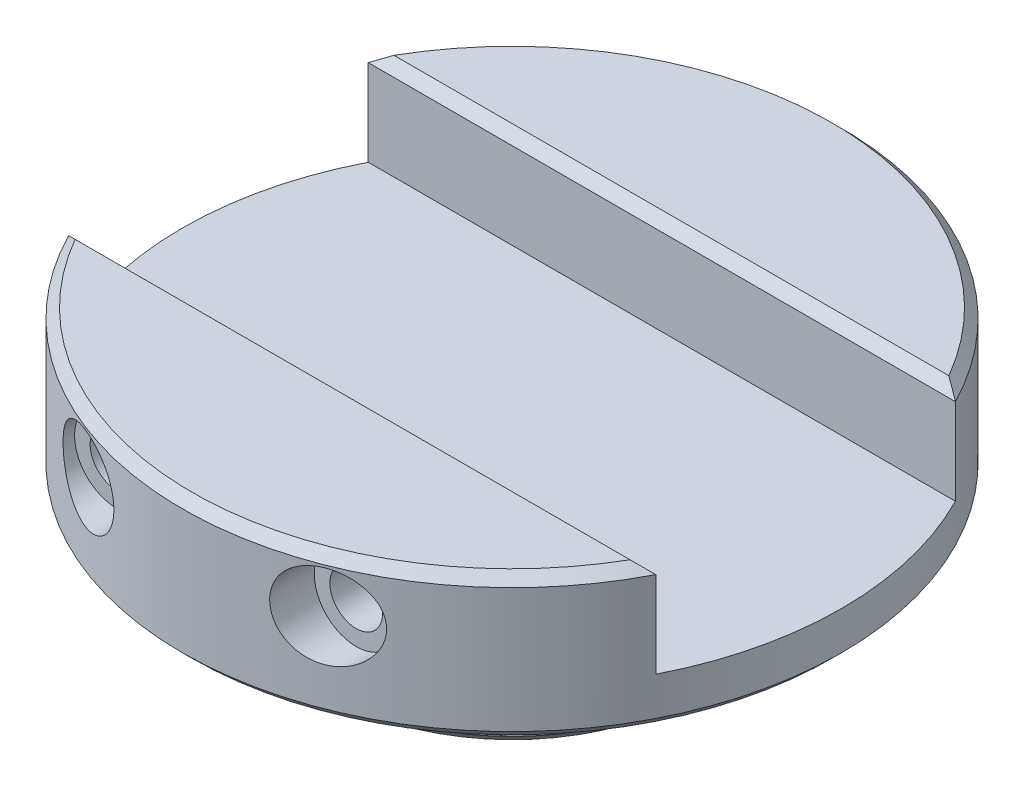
ISO-10303-21;
HEADER;
FILE_DESCRIPTION(('STEP AP214'),'2;1');
FILE_NAME('part.step','',(''),(''),'','','');
FILE_SCHEMA(('AUTOMOTIVE_DESIGN { 1 0 10303 214 1 1 1 1 }'));
ENDSEC;
DATA;
#1=APPLICATION_CONTEXT('core data for automotive mechanical design processes');
#2=APPLICATION_PROTOCOL_DEFINITION('international standard','automotive_design',2000,#1);
#3=PRODUCT_CONTEXT('',#1,'mechanical');
#4=PRODUCT('Part','Part','',(#3));
#5=PRODUCT_RELATED_PRODUCT_CATEGORY('part','',(#4));
#6=PRODUCT_DEFINITION_FORMATION('','',#4);
#7=PRODUCT_DEFINITION_CONTEXT('part definition',#1,'design');
#8=PRODUCT_DEFINITION('design','',#6,#7);
#9=PRODUCT_DEFINITION_SHAPE('','',#8);
#10=(LENGTH_UNIT() NAMED_UNIT(*) SI_UNIT(.MILLI.,.METRE.));
#11=(NAMED_UNIT(*) PLANE_ANGLE_UNIT() SI_UNIT($,.RADIAN.));
#12=(NAMED_UNIT(*) SI_UNIT($,.STERADIAN.) SOLID_ANGLE_UNIT());
#13=UNCERTAINTY_MEASURE_WITH_UNIT(LENGTH_MEASURE(1.E-05),#10,'distance_accuracy_value','');
#14=(GEOMETRIC_REPRESENTATION_CONTEXT(3) GLOBAL_UNCERTAINTY_ASSIGNED_CONTEXT((#13)) GLOBAL_UNIT_ASSIGNED_CONTEXT((#10,
#11,#12)) REPRESENTATION_CONTEXT('',''));
#15=CARTESIAN_POINT('',(0.,0.,0.));
#16=DIRECTION('',(0.,0.,1.));
#17=DIRECTION('',(1.,0.,0.));
#18=AXIS2_PLACEMENT_3D('',#15,#16,#17);
#19=CARTESIAN_POINT('',(0.,19.05,0.));
#20=DIRECTION('',(0.,-1.,0.));
#21=DIRECTION('',(0.,0.,-1.));
#22=AXIS2_PLACEMENT_3D('',#19,#20,#21);
#23=CYLINDRICAL_SURFACE('',#22,43.65625);
#24=CARTESIAN_POINT('',(0.,1.27,0.));
#25=DIRECTION('',(0.,1.,0.));
#26=DIRECTION('',(0.,0.,1.));
#27=AXIS2_PLACEMENT_3D('',#24,#25,#26);
#28=CIRCLE('',#27,43.65625);
#29=CARTESIAN_POINT('',(0.,1.27,43.65625));
#30=VERTEX_POINT('',#29);
#31=EDGE_CURVE('E179',#30,#30,#28,.T.);
#32=ORIENTED_EDGE('',*,*,#31,.T.);
#33=EDGE_LOOP('',(#32));
#34=FACE_BOUND('',#33,.T.);
#35=CARTESIAN_POINT('',(-21.43125,11.90625,38.0337966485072));
#36=CARTESIAN_POINT('',(-21.4312518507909,11.7636928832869,38.033795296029));
#37=CARTESIAN_POINT('',(-21.4257588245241,11.6211568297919,38.0368922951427));
#38=CARTESIAN_POINT('',(-21.4038621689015,11.3371447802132,38.0492182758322));
#39=CARTESIAN_POINT('',(-21.3874555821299,11.1956690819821,38.0584489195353));
#40=CARTESIAN_POINT('',(-21.3439232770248,10.9147807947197,38.0828796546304));
#41=CARTESIAN_POINT('',(-21.3167883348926,10.7753700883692,38.0980848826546));
#42=CARTESIAN_POINT('',(-21.2521303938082,10.4996796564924,38.1341905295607));
#43=CARTESIAN_POINT('',(-21.2146032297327,10.3634012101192,38.1550932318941));
#44=CARTESIAN_POINT('',(-21.1297773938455,10.0954804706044,38.2021335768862));
#45=CARTESIAN_POINT('',(-21.0825193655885,9.96382147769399,38.2282494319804));
#46=CARTESIAN_POINT('',(-20.9786502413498,9.70531785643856,38.2853484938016));
#47=CARTESIAN_POINT('',(-20.9220356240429,9.57847506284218,38.3163335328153));
#48=CARTESIAN_POINT('',(-20.7390167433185,9.20633723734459,38.4158903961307));
#49=CARTESIAN_POINT('',(-20.5993540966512,8.9691730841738,38.4911107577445));
#50=CARTESIAN_POINT('',(-20.2802771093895,8.50788930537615,38.6602243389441));
#51=CARTESIAN_POINT('',(-20.0989873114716,8.28539380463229,38.7549642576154));
#52=CARTESIAN_POINT('',(-19.7074644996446,7.87326791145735,38.9555179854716));
#53=CARTESIAN_POINT('',(-19.4972194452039,7.68365126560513,39.0613363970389));
#54=CARTESIAN_POINT('',(-19.0264146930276,7.3193846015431,39.2930069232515));
#55=CARTESIAN_POINT('',(-18.7628448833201,7.14919102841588,39.4197453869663));
#56=CARTESIAN_POINT('',(-18.2122138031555,6.85584151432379,39.6771426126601));
#57=CARTESIAN_POINT('',(-17.9251416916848,6.73270743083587,39.8078031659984));
#58=CARTESIAN_POINT('',(-17.4710137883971,6.58151890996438,40.0082770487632));
#59=CARTESIAN_POINT('',(-17.3097282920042,6.53581271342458,40.0783361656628));
#60=CARTESIAN_POINT('',(-16.9833992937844,6.45910168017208,40.2177039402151));
#61=CARTESIAN_POINT('',(-16.8183570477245,6.42809200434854,40.2870128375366));
#62=CARTESIAN_POINT('',(-16.4855335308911,6.38108666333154,40.4243465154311));
#63=CARTESIAN_POINT('',(-16.317750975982,6.36509825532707,40.4923706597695));
#64=CARTESIAN_POINT('',(-15.9807570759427,6.34844705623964,40.6265484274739));
#65=CARTESIAN_POINT('',(-15.8115463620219,6.34777781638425,40.6927028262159));
#66=CARTESIAN_POINT('',(-15.4728696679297,6.36197982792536,40.8226820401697));
#67=CARTESIAN_POINT('',(-15.3034036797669,6.37685157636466,40.8865067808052));
#68=CARTESIAN_POINT('',(-14.9656145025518,6.42227704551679,41.0113515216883));
#69=CARTESIAN_POINT('',(-14.7972908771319,6.45282439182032,41.0723726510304));
#70=CARTESIAN_POINT('',(-14.4631231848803,6.52964245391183,41.1912330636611));
#71=CARTESIAN_POINT('',(-14.2972790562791,6.57591277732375,41.2490724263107));
#72=CARTESIAN_POINT('',(-13.9695418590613,6.68409369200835,41.3612144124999));
#73=CARTESIAN_POINT('',(-13.8076485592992,6.74600336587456,41.415517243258));
#74=CARTESIAN_POINT('',(-13.4979467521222,6.8814580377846,41.517450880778));
#75=CARTESIAN_POINT('',(-13.349850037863,6.95419263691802,41.5652836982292));
#76=CARTESIAN_POINT('',(-13.0598672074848,7.11310154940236,41.6573063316));
#77=CARTESIAN_POINT('',(-12.9179806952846,7.19927500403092,41.7014963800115));
#78=CARTESIAN_POINT('',(-12.6417634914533,7.3845528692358,41.7860603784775));
#79=CARTESIAN_POINT('',(-12.5074308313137,7.48365388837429,41.8264353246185));
#80=CARTESIAN_POINT('',(-12.2475758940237,7.69416456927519,41.9032625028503));
#81=CARTESIAN_POINT('',(-12.1220532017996,7.80557365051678,41.9397149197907));
#82=CARTESIAN_POINT('',(-11.8882614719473,8.03290430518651,42.0065625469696));
#83=CARTESIAN_POINT('',(-11.7794097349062,8.14815917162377,42.0371894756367));
#84=CARTESIAN_POINT('',(-11.571570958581,8.38806905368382,42.0948754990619));
#85=CARTESIAN_POINT('',(-11.4725833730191,8.51272354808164,42.121934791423));
#86=CARTESIAN_POINT('',(-11.2853876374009,8.77052910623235,42.1724743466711));
#87=CARTESIAN_POINT('',(-11.197177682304,8.90367874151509,42.1959552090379));
#88=CARTESIAN_POINT('',(-11.03233171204,9.17751120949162,42.2393547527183));
#89=CARTESIAN_POINT('',(-10.9556954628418,9.31819388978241,42.2592735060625));
#90=CARTESIAN_POINT('',(-10.8174160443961,9.60049472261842,42.2948764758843));
#91=CARTESIAN_POINT('',(-10.7553103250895,9.74186973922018,42.3106938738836));
#92=CARTESIAN_POINT('',(-10.6429742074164,10.029634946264,42.339090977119));
#93=CARTESIAN_POINT('',(-10.5927478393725,10.1760268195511,42.3516695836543));
#94=CARTESIAN_POINT('',(-10.5046538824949,10.4726454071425,42.373605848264));
#95=CARTESIAN_POINT('',(-10.4667806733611,10.6228703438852,42.3829649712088));
#96=CARTESIAN_POINT('',(-10.4036778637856,10.9261734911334,42.3984989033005));
#97=CARTESIAN_POINT('',(-10.3784528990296,11.0792527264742,42.4046725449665));
#98=CARTESIAN_POINT('',(-10.3412137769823,11.3843920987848,42.413769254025));
#99=CARTESIAN_POINT('',(-10.328976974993,11.5364234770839,42.4167471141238));
#100=CARTESIAN_POINT('',(-10.3170408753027,11.8410631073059,42.4196519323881));
#101=CARTESIAN_POINT('',(-10.3173461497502,11.9936715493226,42.4195777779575));
#102=CARTESIAN_POINT('',(-10.3305004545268,12.2982512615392,42.4163761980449));
#103=CARTESIAN_POINT('',(-10.343344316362,12.4502227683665,42.4132500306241));
#104=CARTESIAN_POINT('',(-10.3814677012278,12.7525600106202,42.4039346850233));
#105=CARTESIAN_POINT('',(-10.4067518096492,12.9029251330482,42.397744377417));
#106=CARTESIAN_POINT('',(-10.4694081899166,13.2002647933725,42.3823157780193));
#107=CARTESIAN_POINT('',(-10.5067269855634,13.3472513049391,42.3730909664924));
#108=CARTESIAN_POINT('',(-10.5931893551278,13.6375308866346,42.3515582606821));
#109=CARTESIAN_POINT('',(-10.6423372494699,13.7808225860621,42.3392492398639));
#110=CARTESIAN_POINT('',(-10.7520222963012,14.0626037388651,42.3115276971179));
#111=CARTESIAN_POINT('',(-10.812555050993,14.201095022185,42.2961163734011));
#112=CARTESIAN_POINT('',(-10.94454299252,14.4724302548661,42.2621554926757));
#113=CARTESIAN_POINT('',(-11.0160022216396,14.6052720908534,42.2436047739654));
#114=CARTESIAN_POINT('',(-11.1696637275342,14.8650694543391,42.2032357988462));
#115=CARTESIAN_POINT('',(-11.2519221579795,14.9919891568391,42.1814003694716));
#116=CARTESIAN_POINT('',(-11.4261914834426,15.2383402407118,42.1345282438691));
#117=CARTESIAN_POINT('',(-11.5182059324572,15.3577688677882,42.1094903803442));
#118=CARTESIAN_POINT('',(-11.8077302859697,15.7035346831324,42.0295805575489));
#119=CARTESIAN_POINT('',(-12.0188774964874,15.9176145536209,41.9698720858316));
#120=CARTESIAN_POINT('',(-12.4747181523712,16.3110775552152,41.8366696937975));
#121=CARTESIAN_POINT('',(-12.7199743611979,16.4897214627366,41.7629346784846));
#122=CARTESIAN_POINT('',(-13.233232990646,16.8035407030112,41.6031476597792));
#123=CARTESIAN_POINT('',(-13.5012387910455,16.9387095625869,41.5170938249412));
#124=CARTESIAN_POINT('',(-14.0627467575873,17.167724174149,41.3303531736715));
#125=CARTESIAN_POINT('',(-14.3568334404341,17.2597769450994,41.2292302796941));
#126=CARTESIAN_POINT('',(-14.9526384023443,17.3939166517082,41.0169095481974));
#127=CARTESIAN_POINT('',(-15.2543586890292,17.4359903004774,40.9057090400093));
#128=CARTESIAN_POINT('',(-15.8749257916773,17.4716737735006,40.669045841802));
#129=CARTESIAN_POINT('',(-16.1937667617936,17.4623790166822,40.5431313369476));
#130=CARTESIAN_POINT('',(-16.823169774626,17.3901630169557,40.2860376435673));
#131=CARTESIAN_POINT('',(-17.1337291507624,17.3272247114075,40.1548567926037));
#132=CARTESIAN_POINT('',(-17.7559901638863,17.1450187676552,39.8837618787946));
#133=CARTESIAN_POINT('',(-18.0667982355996,17.0228181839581,39.7437672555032));
#134=CARTESIAN_POINT('',(-18.6631081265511,16.7238747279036,39.4672587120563));
#135=CARTESIAN_POINT('',(-18.9486024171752,16.5471156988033,39.3307458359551));
#136=CARTESIAN_POINT('',(-19.3528150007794,16.2428011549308,39.1325925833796));
#137=CARTESIAN_POINT('',(-19.4842430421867,16.1340819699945,39.0672827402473));
#138=CARTESIAN_POINT('',(-19.7373868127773,15.904134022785,38.940001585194));
#139=CARTESIAN_POINT('',(-19.8591067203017,15.7829106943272,38.8780288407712));
#140=CARTESIAN_POINT('',(-20.0917340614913,15.5285136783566,38.7583220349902));
#141=CARTESIAN_POINT('',(-20.2026387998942,15.3953370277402,38.7005890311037));
#142=CARTESIAN_POINT('',(-20.4124114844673,15.1178002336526,38.5903570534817));
#143=CARTESIAN_POINT('',(-20.5112809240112,14.9734414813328,38.5378574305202));
#144=CARTESIAN_POINT('',(-20.6890486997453,14.6853470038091,38.4426956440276));
#145=CARTESIAN_POINT('',(-20.768876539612,14.54232953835,38.3995957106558));
#146=CARTESIAN_POINT('',(-20.9161482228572,14.2484170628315,38.3195763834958));
#147=CARTESIAN_POINT('',(-20.9835942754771,14.0975234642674,38.2826558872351));
#148=CARTESIAN_POINT('',(-21.1050475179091,13.7893037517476,38.2158335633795));
#149=CARTESIAN_POINT('',(-21.1590835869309,13.6319923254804,38.1859166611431));
#150=CARTESIAN_POINT('',(-21.2530473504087,13.3120600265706,38.1336994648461));
#151=CARTESIAN_POINT('',(-21.292982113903,13.1494418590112,38.1113953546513));
#152=CARTESIAN_POINT('',(-21.3605288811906,12.8081126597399,38.0735812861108));
#153=CARTESIAN_POINT('',(-21.3870028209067,12.6291045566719,38.0587003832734));
#154=CARTESIAN_POINT('',(-21.4223618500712,12.2688028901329,38.0388091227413));
#155=CARTESIAN_POINT('',(-21.4312476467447,12.0875094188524,38.0337983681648));
#156=CARTESIAN_POINT('',(-21.43125,11.90625,38.0337966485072));
#157=B_SPLINE_CURVE_WITH_KNOTS('',3,(#35,#36,#37,#38,#39,#40,#41,#42,#43,#44,#45,#46,#47,#48,
#49,#50,#51,#52,#53,#54,#55,#56,#57,#58,#59,#60,#61,#62,#63,#64,#65,#66,#67,#68,#69,#70,#71,#72,
#73,#74,#75,#76,#77,#78,#79,#80,#81,#82,#83,#84,#85,#86,#87,#88,#89,#90,#91,#92,#93,#94,#95,#96,
#97,#98,#99,#100,#101,#102,#103,#104,#105,#106,#107,#108,#109,#110,#111,#112,#113,#114,#115,
#116,#117,#118,#119,#120,#121,#122,#123,#124,#125,#126,#127,#128,#129,#130,#131,#132,#133,#134,
#135,#136,#137,#138,#139,#140,#141,#142,#143,#144,#145,#146,#147,#148,#149,#150,#151,#152,#153,
#154,#155,#156),.UNSPECIFIED.,.T.,.F.,(4,2,2,2,2,2,2,2,2,2,2,2,2,2,2,2,2,2,2,2,2,2,2,2,2,2,2,2,
2,2,2,2,2,2,2,2,2,2,2,2,2,2,2,2,2,2,2,2,2,2,2,2,2,2,2,2,2,2,2,2,4),(0.,0.427496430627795,
0.855108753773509,1.28308952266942,1.71124207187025,2.13764133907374,2.56420144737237,
3.41650109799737,4.31968493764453,5.2232454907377,6.2341831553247,7.24558979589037,
7.79011673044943,8.33446424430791,8.87907461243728,9.42345571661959,9.967854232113,
10.5120315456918,11.0561952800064,11.6003271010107,12.1150294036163,12.6296988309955,
13.144233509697,13.6587439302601,14.1425311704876,14.62629160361,15.1099709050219,
15.5936404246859,16.0587465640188,16.5240102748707,16.9890620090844,17.4542840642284,
17.9113956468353,18.3686738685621,18.8257636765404,19.2830220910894,19.738276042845,
20.1936965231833,20.6489414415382,21.1043551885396,21.562238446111,22.0202890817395,
22.9354765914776,23.8681103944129,24.8008829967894,25.7695977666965,26.7385700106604,
27.7628727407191,28.7875013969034,29.8690080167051,30.9508352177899,31.4981768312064,
32.0452815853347,32.5925223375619,33.1396951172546,33.6470729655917,34.1543601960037,
34.6605452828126,35.1664762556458,35.7100539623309,36.2536098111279),.UNSPECIFIED.);
#158=CARTESIAN_POINT('',(-21.43125,11.90625,38.0337966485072));
#159=VERTEX_POINT('',#158);
#160=EDGE_CURVE('E114',#159,#159,#157,.T.);
#161=ORIENTED_EDGE('',*,*,#160,.F.);
#162=EDGE_LOOP('',(#161));
#163=FACE_BOUND('',#162,.T.);
#164=DIRECTION('',(0.,-1.,0.));
#165=VECTOR('',#164,1.);
#166=CARTESIAN_POINT('',(-38.8856496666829,19.05,-19.84375));
#167=LINE('',#166,#165);
#168=CARTESIAN_POINT('',(-38.885649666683,6.35,-19.84375));
#169=VERTEX_POINT('',#168);
#170=CARTESIAN_POINT('',(-38.8856496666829,17.78,-19.84375));
#171=VERTEX_POINT('',#170);
#172=EDGE_CURVE('E89',#169,#171,#167,.F.);
#173=ORIENTED_EDGE('',*,*,#172,.T.);
#174=CARTESIAN_POINT('',(0.,17.78,0.));
#175=DIRECTION('',(0.,1.,0.));
#176=DIRECTION('',(0.,0.,1.));
#177=AXIS2_PLACEMENT_3D('',#174,#175,#176);
#178=CIRCLE('',#177,43.65625);
#179=CARTESIAN_POINT('',(38.8856496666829,17.78,-19.84375));
#180=VERTEX_POINT('',#179);
#181=EDGE_CURVE('E184',#171,#180,#178,.F.);
#182=ORIENTED_EDGE('',*,*,#181,.T.);
#183=DIRECTION('',(0.,-1.,0.));
#184=VECTOR('',#183,1.);
#185=CARTESIAN_POINT('',(38.8856496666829,19.05,-19.84375));
#186=LINE('',#185,#184);
#187=CARTESIAN_POINT('',(38.885649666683,6.35,-19.84375));
#188=VERTEX_POINT('',#187);
#189=EDGE_CURVE('E108',#180,#188,#186,.T.);
#190=ORIENTED_EDGE('',*,*,#189,.T.);
#191=CARTESIAN_POINT('',(0.,6.35,0.));
#192=DIRECTION('',(0.,1.,0.));
#193=DIRECTION('',(0.,0.,1.));
#194=AXIS2_PLACEMENT_3D('',#191,#192,#193);
#195=CIRCLE('',#194,43.65625);
#196=CARTESIAN_POINT('',(38.885649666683,6.35,19.84375));
#197=VERTEX_POINT('',#196);
#198=EDGE_CURVE('E99',#197,#188,#195,.T.);
#199=ORIENTED_EDGE('',*,*,#198,.F.);
#200=DIRECTION('',(0.,-1.,0.));
#201=VECTOR('',#200,1.);
#202=CARTESIAN_POINT('',(38.8856496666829,19.05,19.84375));
#203=LINE('',#202,#201);
#204=CARTESIAN_POINT('',(38.8856496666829,17.78,19.84375));
#205=VERTEX_POINT('',#204);
#206=EDGE_CURVE('E121',#197,#205,#203,.F.);
#207=ORIENTED_EDGE('',*,*,#206,.T.);
#208=CARTESIAN_POINT('',(0.,17.78,0.));
#209=DIRECTION('',(0.,1.,0.));
#210=DIRECTION('',(0.,0.,1.));
#211=AXIS2_PLACEMENT_3D('',#208,#209,#210);
#212=CIRCLE('',#211,43.65625);
#213=CARTESIAN_POINT('',(-38.8856496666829,17.78,19.84375));
#214=VERTEX_POINT('',#213);
#215=EDGE_CURVE('E189',#205,#214,#212,.F.);
#216=ORIENTED_EDGE('',*,*,#215,.T.);
#217=DIRECTION('',(0.,-1.,0.));
#218=VECTOR('',#217,1.);
#219=CARTESIAN_POINT('',(-38.8856496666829,19.05,19.84375));
#220=LINE('',#219,#218);
#221=CARTESIAN_POINT('',(-38.885649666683,6.35,19.84375));
#222=VERTEX_POINT('',#221);
#223=EDGE_CURVE('E93',#214,#222,#220,.T.);
#224=ORIENTED_EDGE('',*,*,#223,.T.);
#225=EDGE_CURVE('E85',#169,#222,#195,.T.);
#226=ORIENTED_EDGE('',*,*,#225,.F.);
#227=EDGE_LOOP('',(#173,#182,#190,#199,#207,#216,#224,#226));
#228=FACE_BOUND('',#227,.T.);
#229=CARTESIAN_POINT('',(10.31875,11.90625,42.4192357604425));
#230=CARTESIAN_POINT('',(10.3187484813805,11.7539260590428,42.4192358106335));
#231=CARTESIAN_POINT('',(10.3250168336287,11.6016241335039,42.4177126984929));
#232=CARTESIAN_POINT('',(10.3500372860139,11.2980615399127,42.4116147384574));
#233=CARTESIAN_POINT('',(10.3687924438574,11.1468011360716,42.4070391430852));
#234=CARTESIAN_POINT('',(10.4186545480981,10.8463341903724,42.3948164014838));
#235=CARTESIAN_POINT('',(10.449771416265,10.6971293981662,42.3871667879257));
#236=CARTESIAN_POINT('',(10.5241092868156,10.4019024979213,42.3687709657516));
#237=CARTESIAN_POINT('',(10.5673347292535,10.2558815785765,42.3580236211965));
#238=CARTESIAN_POINT('',(10.6654664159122,9.96827834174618,42.3334211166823));
#239=CARTESIAN_POINT('',(10.7203591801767,9.82669111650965,42.3195695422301));
#240=CARTESIAN_POINT('',(10.8414191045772,9.54871585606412,42.2887183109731));
#241=CARTESIAN_POINT('',(10.9075904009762,9.41232975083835,42.2717174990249));
#242=CARTESIAN_POINT('',(11.0505985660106,9.14582985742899,42.2345579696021));
#243=CARTESIAN_POINT('',(11.1274288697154,9.0157122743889,42.2144011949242));
#244=CARTESIAN_POINT('',(11.2911806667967,8.76248509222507,42.1708973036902));
#245=CARTESIAN_POINT('',(11.3781059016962,8.63937811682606,42.1475490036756));
#246=CARTESIAN_POINT('',(11.5619673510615,8.40017214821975,42.0974846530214));
#247=CARTESIAN_POINT('',(11.6589707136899,8.28412956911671,42.0707457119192));
#248=CARTESIAN_POINT('',(11.8617065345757,8.06071328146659,42.0140353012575));
#249=CARTESIAN_POINT('',(11.9674421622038,7.95334274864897,41.9840626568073));
#250=CARTESIAN_POINT('',(12.1867259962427,7.74799242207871,41.9209361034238));
#251=CARTESIAN_POINT('',(12.3002719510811,7.65000994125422,41.8877831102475));
#252=CARTESIAN_POINT('',(12.5343489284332,7.46391615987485,41.8183353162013));
#253=CARTESIAN_POINT('',(12.6548825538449,7.37580857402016,41.7820393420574));
#254=CARTESIAN_POINT('',(12.9051038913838,7.2078560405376,41.7054433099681));
#255=CARTESIAN_POINT('',(13.0349461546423,7.12827697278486,41.6650651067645));
#256=CARTESIAN_POINT('',(13.2999910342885,6.98037064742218,41.5812185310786));
#257=CARTESIAN_POINT('',(13.4351955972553,6.91204752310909,41.5377490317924));
#258=CARTESIAN_POINT('',(13.7098873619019,6.78697655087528,41.4478950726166));
#259=CARTESIAN_POINT('',(13.849373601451,6.73022612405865,41.4015112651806));
#260=CARTESIAN_POINT('',(14.1316653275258,6.6284425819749,41.3060102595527));
#261=CARTESIAN_POINT('',(14.2744720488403,6.58341390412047,41.2568920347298));
#262=CARTESIAN_POINT('',(14.7196446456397,6.46251362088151,41.1011132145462));
#263=CARTESIAN_POINT('',(15.0261598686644,6.40656679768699,40.9901219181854));
#264=CARTESIAN_POINT('',(15.6408279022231,6.34633371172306,40.7595479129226));
#265=CARTESIAN_POINT('',(15.9489811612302,6.34206241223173,40.6399627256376));
#266=CARTESIAN_POINT('',(16.5779649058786,6.38511671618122,40.3876301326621));
#267=CARTESIAN_POINT('',(16.8984421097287,6.43556327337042,40.2545237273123));
#268=CARTESIAN_POINT('',(17.5248432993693,6.59077886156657,39.9858032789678));
#269=CARTESIAN_POINT('',(17.8307622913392,6.69556638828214,39.850188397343));
#270=CARTESIAN_POINT('',(18.4340345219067,6.96289704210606,39.5748539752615));
#271=CARTESIAN_POINT('',(18.7303918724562,7.12781481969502,39.4352223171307));
#272=CARTESIAN_POINT('',(19.1504452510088,7.41489567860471,39.2320417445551));
#273=CARTESIAN_POINT('',(19.2864681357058,7.51729119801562,39.1653154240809));
#274=CARTESIAN_POINT('',(19.5493273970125,7.73488416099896,39.0347717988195));
#275=CARTESIAN_POINT('',(19.6761680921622,7.85007552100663,38.9709531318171));
#276=CARTESIAN_POINT('',(19.9174106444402,8.09057986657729,38.8482037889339));
#277=CARTESIAN_POINT('',(20.0319923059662,8.21567872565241,38.789206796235));
#278=CARTESIAN_POINT('',(20.250073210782,8.47702392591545,38.6758037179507));
#279=CARTESIAN_POINT('',(20.3535778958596,8.61326473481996,38.6213953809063));
#280=CARTESIAN_POINT('',(20.548374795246,8.89610761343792,38.5181076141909));
#281=CARTESIAN_POINT('',(20.6396717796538,9.04270560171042,38.46922602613));
#282=CARTESIAN_POINT('',(20.8089235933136,9.34532170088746,38.3779378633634));
#283=CARTESIAN_POINT('',(20.8868803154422,9.50133847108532,38.3355303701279));
#284=CARTESIAN_POINT('',(21.0210846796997,9.80519636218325,38.2620883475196));
#285=CARTESIAN_POINT('',(21.0787365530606,9.95224424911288,38.2303345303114));
#286=CARTESIAN_POINT('',(21.1815988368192,10.2518618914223,38.1734396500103));
#287=CARTESIAN_POINT('',(21.2268111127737,10.404430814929,38.1482975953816));
#288=CARTESIAN_POINT('',(21.304105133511,10.7137230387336,38.1051863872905));
#289=CARTESIAN_POINT('',(21.3361974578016,10.870442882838,38.0872114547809));
#290=CARTESIAN_POINT('',(21.3867918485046,11.1867332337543,38.05882482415));
#291=CARTESIAN_POINT('',(21.4052954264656,11.346303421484,38.0484122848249));
#292=CARTESIAN_POINT('',(21.427037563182,11.6477142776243,38.03617164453));
#293=CARTESIAN_POINT('',(21.4318278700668,11.7894102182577,38.0334709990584));
#294=CARTESIAN_POINT('',(21.4305612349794,12.0727348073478,38.0341847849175));
#295=CARTESIAN_POINT('',(21.424504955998,12.2143634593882,38.0375988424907));
#296=CARTESIAN_POINT('',(21.4016270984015,12.4964432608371,38.0504755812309));
#297=CARTESIAN_POINT('',(21.3848073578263,12.6368946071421,38.0599372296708));
#298=CARTESIAN_POINT('',(21.3406232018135,12.9155997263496,38.0847292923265));
#299=CARTESIAN_POINT('',(21.3132586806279,13.0538534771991,38.1000597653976));
#300=CARTESIAN_POINT('',(21.2494088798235,13.3226081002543,38.1357060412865));
#301=CARTESIAN_POINT('',(21.2132600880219,13.4532135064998,38.1558375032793));
#302=CARTESIAN_POINT('',(21.1318223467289,13.7106868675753,38.201000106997));
#303=CARTESIAN_POINT('',(21.0865304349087,13.8375535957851,38.2260328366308));
#304=CARTESIAN_POINT('',(20.9376114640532,14.2113959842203,38.3079295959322));
#305=CARTESIAN_POINT('',(20.8208924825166,14.4518157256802,38.3716197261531));
#306=CARTESIAN_POINT('',(20.5474929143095,14.9261741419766,38.5187531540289));
#307=CARTESIAN_POINT('',(20.3885876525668,15.1584822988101,38.6032667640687));
#308=CARTESIAN_POINT('',(20.0406281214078,15.5936769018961,38.7850473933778));
#309=CARTESIAN_POINT('',(19.851560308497,15.7965500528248,38.8823201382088));
#310=CARTESIAN_POINT('',(19.4245124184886,16.1919468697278,39.0975711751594));
#311=CARTESIAN_POINT('',(19.1833980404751,16.3804860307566,39.2166405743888));
#312=CARTESIAN_POINT('',(18.6756631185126,16.7146336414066,39.4609556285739));
#313=CARTESIAN_POINT('',(18.4090305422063,16.8602217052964,39.5862041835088));
#314=CARTESIAN_POINT('',(17.9818942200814,17.0502056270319,39.7812441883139));
#315=CARTESIAN_POINT('',(17.8280220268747,17.1105672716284,39.8504587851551));
#316=CARTESIAN_POINT('',(17.5154984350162,17.2173626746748,39.988806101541));
#317=CARTESIAN_POINT('',(17.356848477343,17.2638005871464,40.0579388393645));
#318=CARTESIAN_POINT('',(17.0356847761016,17.342432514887,40.1955739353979));
#319=CARTESIAN_POINT('',(16.8731688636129,17.3746183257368,40.2640759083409));
#320=CARTESIAN_POINT('',(16.5454749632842,17.4243863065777,40.3998373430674));
#321=CARTESIAN_POINT('',(16.3802980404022,17.4419741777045,40.4670972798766));
#322=CARTESIAN_POINT('',(16.0447859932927,17.4625017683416,40.6013096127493));
#323=CARTESIAN_POINT('',(15.8744160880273,17.4651202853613,40.6682246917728));
#324=CARTESIAN_POINT('',(15.5333345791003,17.4546080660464,40.7997190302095));
#325=CARTESIAN_POINT('',(15.3626231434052,17.4414837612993,40.8642992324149));
#326=CARTESIAN_POINT('',(15.0220876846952,17.3993271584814,40.9907067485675));
#327=CARTESIAN_POINT('',(14.8522639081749,17.370290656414,41.0525333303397));
#328=CARTESIAN_POINT('',(14.5150528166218,17.2962628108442,41.1729697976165));
#329=CARTESIAN_POINT('',(14.3476643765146,17.2512790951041,41.2315812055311));
#330=CARTESIAN_POINT('',(14.0239415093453,17.147729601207,41.3427773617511));
#331=CARTESIAN_POINT('',(13.8674428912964,17.0898393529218,41.3955133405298));
#332=CARTESIAN_POINT('',(13.559393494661,16.9597458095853,41.4974375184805));
#333=CARTESIAN_POINT('',(13.407840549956,16.8875488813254,41.5466272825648));
#334=CARTESIAN_POINT('',(13.1110146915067,16.7291737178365,41.641250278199));
#335=CARTESIAN_POINT('',(12.9657410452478,16.6429971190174,41.6866839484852));
#336=CARTESIAN_POINT('',(12.682848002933,16.457152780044,41.7736212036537));
#337=CARTESIAN_POINT('',(12.5452281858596,16.3574857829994,41.8151250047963));
#338=CARTESIAN_POINT('',(12.2873212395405,16.1519473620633,41.8916084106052));
#339=CARTESIAN_POINT('',(12.1664884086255,16.0468512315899,41.9268335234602));
#340=CARTESIAN_POINT('',(11.9338406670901,15.8260576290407,41.993645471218));
#341=CARTESIAN_POINT('',(11.8220252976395,15.710360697,42.025232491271));
#342=CARTESIAN_POINT('',(11.608435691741,15.4691554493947,42.0847321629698));
#343=CARTESIAN_POINT('',(11.5066619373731,15.3436466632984,42.1126446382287));
#344=CARTESIAN_POINT('',(11.3141193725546,15.0837388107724,42.1647817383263));
#345=CARTESIAN_POINT('',(11.2233500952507,14.9493401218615,42.1890065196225));
#346=CARTESIAN_POINT('',(11.0574606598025,14.6788424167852,42.2327806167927));
#347=CARTESIAN_POINT('',(10.9818233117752,14.5430862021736,42.252490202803));
#348=CARTESIAN_POINT('',(10.8420412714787,14.2653613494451,42.2885743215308));
#349=CARTESIAN_POINT('',(10.7778960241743,14.1233930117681,42.304949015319));
#350=CARTESIAN_POINT('',(10.6617249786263,13.8344346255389,42.3343758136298));
#351=CARTESIAN_POINT('',(10.6096854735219,13.6874504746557,42.3474316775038));
#352=CARTESIAN_POINT('',(10.5181029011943,13.3894447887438,42.3702713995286));
#353=CARTESIAN_POINT('',(10.4785565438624,13.2384243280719,42.3800561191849));
#354=CARTESIAN_POINT('',(10.403402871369,12.8925001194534,42.3985763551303));
#355=CARTESIAN_POINT('',(10.3716924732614,12.6966838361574,42.4063276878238));
#356=CARTESIAN_POINT('',(10.329367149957,12.3026492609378,42.4166573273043));
#357=CARTESIAN_POINT('',(10.3187519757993,12.1044309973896,42.4192356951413));
#358=CARTESIAN_POINT('',(10.31875,11.90625,42.4192357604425));
#359=B_SPLINE_CURVE_WITH_KNOTS('',3,(#229,#230,#231,#232,#233,#234,#235,#236,#237,#238,#239,
#240,#241,#242,#243,#244,#245,#246,#247,#248,#249,#250,#251,#252,#253,#254,#255,#256,#257,#258,
#259,#260,#261,#262,#263,#264,#265,#266,#267,#268,#269,#270,#271,#272,#273,#274,#275,#276,#277,
#278,#279,#280,#281,#282,#283,#284,#285,#286,#287,#288,#289,#290,#291,#292,#293,#294,#295,#296,
#297,#298,#299,#300,#301,#302,#303,#304,#305,#306,#307,#308,#309,#310,#311,#312,#313,#314,#315,
#316,#317,#318,#319,#320,#321,#322,#323,#324,#325,#326,#327,#328,#329,#330,#331,#332,#333,#334,
#335,#336,#337,#338,#339,#340,#341,#342,#343,#344,#345,#346,#347,#348,#349,#350,#351,#352,#353,
#354,#355,#356,#357,#358),.UNSPECIFIED.,.T.,.F.,(4,2,2,2,2,2,2,2,2,2,2,2,2,2,2,2,2,2,2,2,2,2,2,
2,2,2,2,2,2,2,2,2,2,2,2,2,2,2,2,2,2,2,2,2,2,2,2,2,2,2,2,2,2,2,2,2,2,2,2,2,2,2,2,2,4),(0.,
0.456797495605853,0.913706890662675,1.37098375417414,1.82842851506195,2.28534760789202,
2.74243463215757,3.19924137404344,3.65621796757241,4.11646264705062,4.57687511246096,
5.03715540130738,5.49760825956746,5.96972643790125,6.44201759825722,6.91420339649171,
7.38656768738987,8.37412467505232,9.36196761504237,10.4092662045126,11.4569214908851,
12.5514578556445,13.0994841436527,13.6472509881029,14.1853653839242,14.7232141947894,
15.2608522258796,15.7984139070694,16.2810545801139,16.763622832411,17.2458011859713,
17.7279258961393,18.1528002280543,18.5776485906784,19.0024244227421,19.4272045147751,
19.8377454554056,20.2484196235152,21.069146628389,21.9472997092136,22.8258482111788,
23.8071334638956,24.7888837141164,25.3259554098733,25.8628667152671,26.4000867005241,
26.9370967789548,27.4855876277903,28.0338544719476,28.5822662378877,29.130416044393,
29.6547341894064,30.1788195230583,30.7028435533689,31.2268387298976,31.7181349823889,
32.2094062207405,32.7007010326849,33.1919749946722,33.6613515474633,34.1307054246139,
34.5995252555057,35.0682215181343,35.6625447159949,36.25686089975),.UNSPECIFIED.);
#360=CARTESIAN_POINT('',(10.31875,11.90625,42.4192357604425));
#361=VERTEX_POINT('',#360);
#362=EDGE_CURVE('E133',#361,#361,#359,.T.);
#363=ORIENTED_EDGE('',*,*,#362,.F.);
#364=EDGE_LOOP('',(#363));
#365=FACE_BOUND('',#364,.T.);
#366=ADVANCED_FACE('F31',(#34,#163,#228,#365),#23,.T.);
#367=CARTESIAN_POINT('',(0.,19.05,0.));
#368=DIRECTION('',(0.,1.,0.));
#369=DIRECTION('',(0.,0.,1.));
#370=AXIS2_PLACEMENT_3D('',#367,#368,#369);
#371=PLANE('',#370);
#372=DIRECTION('',(-1.,0.,0.));
#373=VECTOR('',#372,1.);
#374=CARTESIAN_POINT('',(-38.885649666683,19.05,21.11375));
#375=LINE('',#374,#373);
#376=CARTESIAN_POINT('',(36.753282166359,19.05,21.11375));
#377=VERTEX_POINT('',#376);
#378=CARTESIAN_POINT('',(-36.753282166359,19.05,21.11375));
#379=VERTEX_POINT('',#378);
#380=EDGE_CURVE('E45',#377,#379,#375,.T.);
#381=ORIENTED_EDGE('',*,*,#380,.T.);
#382=CARTESIAN_POINT('',(0.,19.05,0.));
#383=DIRECTION('',(0.,1.,0.));
#384=DIRECTION('',(0.,0.,1.));
#385=AXIS2_PLACEMENT_3D('',#382,#383,#384);
#386=CIRCLE('',#385,42.38625);
#387=EDGE_CURVE('E39',#379,#377,#386,.T.);
#388=ORIENTED_EDGE('',*,*,#387,.T.);
#389=EDGE_LOOP('',(#381,#388));
#390=FACE_BOUND('',#389,.T.);
#391=ADVANCED_FACE('F165',(#390),#371,.T.);
#392=CARTESIAN_POINT('',(0.,0.,0.));
#393=DIRECTION('',(0.,1.,0.));
#394=DIRECTION('',(0.,0.,1.));
#395=AXIS2_PLACEMENT_3D('',#392,#393,#394);
#396=PLANE('',#395);
#397=CARTESIAN_POINT('',(0.,0.,0.));
#398=DIRECTION('',(0.,1.,0.));
#399=DIRECTION('',(0.,0.,1.));
#400=AXIS2_PLACEMENT_3D('',#397,#398,#399);
#401=CIRCLE('',#400,42.38625);
#402=CARTESIAN_POINT('',(0.,0.,42.38625));
#403=VERTEX_POINT('',#402);
#404=EDGE_CURVE('E183',#403,#403,#401,.F.);
#405=ORIENTED_EDGE('',*,*,#404,.T.);
#406=EDGE_LOOP('',(#405));
#407=FACE_BOUND('',#406,.T.);
#408=CARTESIAN_POINT('',(0.,0.,0.));
#409=DIRECTION('',(0.,1.,0.));
#410=DIRECTION('',(0.,0.,1.));
#411=AXIS2_PLACEMENT_3D('',#408,#409,#410);
#412=CIRCLE('',#411,25.3619);
#413=CARTESIAN_POINT('',(0.,0.,25.3619));
#414=VERTEX_POINT('',#413);
#415=EDGE_CURVE('E125',#414,#414,#412,.F.);
#416=ORIENTED_EDGE('',*,*,#415,.F.);
#417=EDGE_LOOP('',(#416));
#418=FACE_BOUND('',#417,.T.);
#419=ADVANCED_FACE('F163',(#407,#418),#396,.F.);
#420=DIRECTION('',(1.,0.,0.));
#421=VECTOR('',#420,1.);
#422=CARTESIAN_POINT('',(38.885649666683,19.05,-21.11375));
#423=LINE('',#422,#421);
#424=CARTESIAN_POINT('',(-36.753282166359,19.05,-21.11375));
#425=VERTEX_POINT('',#424);
#426=CARTESIAN_POINT('',(36.753282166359,19.05,-21.11375));
#427=VERTEX_POINT('',#426);
#428=EDGE_CURVE('E187',#425,#427,#423,.T.);
#429=ORIENTED_EDGE('',*,*,#428,.T.);
#430=CARTESIAN_POINT('',(0.,19.05,0.));
#431=DIRECTION('',(0.,1.,0.));
#432=DIRECTION('',(0.,0.,1.));
#433=AXIS2_PLACEMENT_3D('',#430,#431,#432);
#434=CIRCLE('',#433,42.38625);
#435=EDGE_CURVE('E194',#427,#425,#434,.T.);
#436=ORIENTED_EDGE('',*,*,#435,.T.);
#437=EDGE_LOOP('',(#429,#436));
#438=FACE_BOUND('',#437,.T.);
#439=ADVANCED_FACE('F161',(#438),#371,.T.);
#440=CARTESIAN_POINT('',(0.,-13.49375,0.));
#441=DIRECTION('',(0.,1.,0.));
#442=DIRECTION('',(0.,0.,1.));
#443=AXIS2_PLACEMENT_3D('',#440,#441,#442);
#444=CYLINDRICAL_SURFACE('',#443,25.3619);
#445=CARTESIAN_POINT('',(0.,-12.22375,0.));
#446=DIRECTION('',(0.,-1.,0.));
#447=DIRECTION('',(0.,0.,-1.));
#448=AXIS2_PLACEMENT_3D('',#445,#446,#447);
#449=CIRCLE('',#448,25.3619);
#450=CARTESIAN_POINT('',(0.,-12.22375,-25.3619));
#451=VERTEX_POINT('',#450);
#452=EDGE_CURVE('E207',#451,#451,#449,.F.);
#453=ORIENTED_EDGE('',*,*,#452,.T.);
#454=EDGE_LOOP('',(#453));
#455=FACE_BOUND('',#454,.T.);
#456=ORIENTED_EDGE('',*,*,#415,.T.);
#457=EDGE_LOOP('',(#456));
#458=FACE_BOUND('',#457,.T.);
#459=ADVANCED_FACE('F157',(#455,#458),#444,.T.);
#460=CARTESIAN_POINT('',(0.,-13.49375,0.));
#461=DIRECTION('',(0.,-1.,0.));
#462=DIRECTION('',(0.,0.,-1.));
#463=AXIS2_PLACEMENT_3D('',#460,#461,#462);
#464=PLANE('',#463);
#465=CARTESIAN_POINT('',(0.,-13.49375,0.));
#466=DIRECTION('',(0.,-1.,0.));
#467=DIRECTION('',(0.,0.,-1.));
#468=AXIS2_PLACEMENT_3D('',#465,#466,#467);
#469=CIRCLE('',#468,24.0919);
#470=CARTESIAN_POINT('',(0.,-13.49375,-24.0919));
#471=VERTEX_POINT('',#470);
#472=EDGE_CURVE('E98',#471,#471,#469,.T.);
#473=ORIENTED_EDGE('',*,*,#472,.T.);
#474=EDGE_LOOP('',(#473));
#475=FACE_BOUND('',#474,.T.);
#476=ADVANCED_FACE('F151',(#475),#464,.T.);
#477=CARTESIAN_POINT('',(-43.65625,6.35,-19.84375));
#478=DIRECTION('',(0.,1.,0.));
#479=DIRECTION('',(0.,0.,1.));
#480=AXIS2_PLACEMENT_3D('',#477,#478,#479);
#481=PLANE('',#480);
#482=DIRECTION('',(1.,0.,0.));
#483=VECTOR('',#482,1.);
#484=CARTESIAN_POINT('',(-43.65625,6.35,19.84375));
#485=LINE('',#484,#483);
#486=EDGE_CURVE('E112',#222,#197,#485,.T.);
#487=ORIENTED_EDGE('',*,*,#486,.T.);
#488=ORIENTED_EDGE('',*,*,#198,.T.);
#489=DIRECTION('',(1.,0.,0.));
#490=VECTOR('',#489,1.);
#491=CARTESIAN_POINT('',(-43.65625,6.35,-19.84375));
#492=LINE('',#491,#490);
#493=EDGE_CURVE('E105',#169,#188,#492,.T.);
#494=ORIENTED_EDGE('',*,*,#493,.F.);
#495=ORIENTED_EDGE('',*,*,#225,.T.);
#496=EDGE_LOOP('',(#487,#488,#494,#495));
#497=FACE_BOUND('',#496,.T.);
#498=ADVANCED_FACE('F111',(#497),#481,.T.);
#499=CARTESIAN_POINT('',(-43.65625,19.05,19.84375));
#500=DIRECTION('',(0.,0.,1.));
#501=DIRECTION('',(0.,-1.,0.));
#502=AXIS2_PLACEMENT_3D('',#499,#500,#501);
#503=PLANE('',#502);
#504=CARTESIAN_POINT('',(15.875,11.90625,19.84375));
#505=DIRECTION('',(0.,0.,1.));
#506=DIRECTION('',(0.,-1.,0.));
#507=AXIS2_PLACEMENT_3D('',#504,#505,#506);
#508=CIRCLE('',#507,3.4925);
#509=CARTESIAN_POINT('',(15.875,8.41375000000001,19.84375));
#510=VERTEX_POINT('',#509);
#511=EDGE_CURVE('E259',#510,#510,#508,.F.);
#512=ORIENTED_EDGE('',*,*,#511,.F.);
#513=EDGE_LOOP('',(#512));
#514=FACE_BOUND('',#513,.T.);
#515=CARTESIAN_POINT('',(-15.875,11.90625,19.84375));
#516=DIRECTION('',(0.,0.,1.));
#517=DIRECTION('',(0.,-1.,0.));
#518=AXIS2_PLACEMENT_3D('',#515,#516,#517);
#519=CIRCLE('',#518,3.4925);
#520=CARTESIAN_POINT('',(-15.875,8.41375000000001,19.84375));
#521=VERTEX_POINT('',#520);
#522=EDGE_CURVE('E251',#521,#521,#519,.F.);
#523=ORIENTED_EDGE('',*,*,#522,.F.);
#524=EDGE_LOOP('',(#523));
#525=FACE_BOUND('',#524,.T.);
#526=ORIENTED_EDGE('',*,*,#223,.F.);
#527=DIRECTION('',(1.,0.,0.));
#528=VECTOR('',#527,1.);
#529=CARTESIAN_POINT('',(38.885649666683,17.78,19.84375));
#530=LINE('',#529,#528);
#531=EDGE_CURVE('E11',#214,#205,#530,.T.);
#532=ORIENTED_EDGE('',*,*,#531,.T.);
#533=ORIENTED_EDGE('',*,*,#206,.F.);
#534=ORIENTED_EDGE('',*,*,#486,.F.);
#535=EDGE_LOOP('',(#526,#532,#533,#534));
#536=FACE_BOUND('',#535,.T.);
#537=ADVANCED_FACE('F148',(#514,#525,#536),#503,.F.);
#538=CARTESIAN_POINT('',(-43.65625,6.35,-19.84375));
#539=DIRECTION('',(0.,0.,-1.));
#540=DIRECTION('',(0.,1.,0.));
#541=AXIS2_PLACEMENT_3D('',#538,#539,#540);
#542=PLANE('',#541);
#543=ORIENTED_EDGE('',*,*,#189,.F.);
#544=DIRECTION('',(-1.,0.,0.));
#545=VECTOR('',#544,1.);
#546=CARTESIAN_POINT('',(-38.885649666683,17.78,-19.84375));
#547=LINE('',#546,#545);
#548=EDGE_CURVE('E107',#180,#171,#547,.T.);
#549=ORIENTED_EDGE('',*,*,#548,.T.);
#550=ORIENTED_EDGE('',*,*,#172,.F.);
#551=ORIENTED_EDGE('',*,*,#493,.T.);
#552=EDGE_LOOP('',(#543,#549,#550,#551));
#553=FACE_BOUND('',#552,.T.);
#554=ADVANCED_FACE('F104',(#553),#542,.F.);
#555=CARTESIAN_POINT('',(-15.875,11.90625,43.65625));
#556=DIRECTION('',(0.,0.,-1.));
#557=DIRECTION('',(-1.,0.,0.));
#558=AXIS2_PLACEMENT_3D('',#555,#556,#557);
#559=CYLINDRICAL_SURFACE('',#558,5.55625);
#560=CARTESIAN_POINT('',(-15.875,11.90625,36.5125));
#561=DIRECTION('',(0.,0.,1.));
#562=DIRECTION('',(1.,0.,0.));
#563=AXIS2_PLACEMENT_3D('',#560,#561,#562);
#564=CIRCLE('',#563,5.55625);
#565=CARTESIAN_POINT('',(-10.31875,11.90625,36.5125));
#566=VERTEX_POINT('',#565);
#567=EDGE_CURVE('E117',#566,#566,#564,.T.);
#568=ORIENTED_EDGE('',*,*,#567,.F.);
#569=EDGE_LOOP('',(#568));
#570=FACE_BOUND('',#569,.T.);
#571=ORIENTED_EDGE('',*,*,#160,.T.);
#572=EDGE_LOOP('',(#571));
#573=FACE_BOUND('',#572,.T.);
#574=ADVANCED_FACE('F138',(#570,#573),#559,.F.);
#575=CARTESIAN_POINT('',(-15.875,11.90625,36.5125));
#576=DIRECTION('',(0.,0.,1.));
#577=DIRECTION('',(1.,0.,0.));
#578=AXIS2_PLACEMENT_3D('',#575,#576,#577);
#579=PLANE('',#578);
#580=CARTESIAN_POINT('',(-15.875,11.90625,36.5125));
#581=DIRECTION('',(0.,0.,1.));
#582=DIRECTION('',(1.,0.,0.));
#583=AXIS2_PLACEMENT_3D('',#580,#581,#582);
#584=CIRCLE('',#583,3.4925);
#585=CARTESIAN_POINT('',(-12.3825,11.90625,36.5125));
#586=VERTEX_POINT('',#585);
#587=EDGE_CURVE('E248',#586,#586,#584,.T.);
#588=ORIENTED_EDGE('',*,*,#587,.F.);
#589=EDGE_LOOP('',(#588));
#590=FACE_BOUND('',#589,.T.);
#591=ORIENTED_EDGE('',*,*,#567,.T.);
#592=EDGE_LOOP('',(#591));
#593=FACE_BOUND('',#592,.T.);
#594=ADVANCED_FACE('F143',(#590,#593),#579,.T.);
#595=CARTESIAN_POINT('',(-15.875,11.90625,-43.65725));
#596=DIRECTION('',(0.,0.,1.));
#597=DIRECTION('',(1.,0.,0.));
#598=AXIS2_PLACEMENT_3D('',#595,#596,#597);
#599=CYLINDRICAL_SURFACE('',#598,3.4925);
#600=ORIENTED_EDGE('',*,*,#587,.T.);
#601=EDGE_LOOP('',(#600));
#602=FACE_BOUND('',#601,.T.);
#603=ORIENTED_EDGE('',*,*,#522,.T.);
#604=EDGE_LOOP('',(#603));
#605=FACE_BOUND('',#604,.T.);
#606=ADVANCED_FACE('F237',(#602,#605),#599,.F.);
#607=CARTESIAN_POINT('',(15.875,11.90625,43.65625));
#608=DIRECTION('',(0.,0.,-1.));
#609=DIRECTION('',(-1.,0.,0.));
#610=AXIS2_PLACEMENT_3D('',#607,#608,#609);
#611=CYLINDRICAL_SURFACE('',#610,5.55625);
#612=CARTESIAN_POINT('',(15.875,11.90625,36.5125));
#613=DIRECTION('',(0.,0.,1.));
#614=DIRECTION('',(1.,0.,0.));
#615=AXIS2_PLACEMENT_3D('',#612,#613,#614);
#616=CIRCLE('',#615,5.55625);
#617=CARTESIAN_POINT('',(21.43125,11.90625,36.5125));
#618=VERTEX_POINT('',#617);
#619=EDGE_CURVE('E256',#618,#618,#616,.T.);
#620=ORIENTED_EDGE('',*,*,#619,.F.);
#621=EDGE_LOOP('',(#620));
#622=FACE_BOUND('',#621,.T.);
#623=ORIENTED_EDGE('',*,*,#362,.T.);
#624=EDGE_LOOP('',(#623));
#625=FACE_BOUND('',#624,.T.);
#626=ADVANCED_FACE('F233',(#622,#625),#611,.F.);
#627=CARTESIAN_POINT('',(15.875,11.90625,36.5125));
#628=DIRECTION('',(0.,0.,1.));
#629=DIRECTION('',(1.,0.,0.));
#630=AXIS2_PLACEMENT_3D('',#627,#628,#629);
#631=PLANE('',#630);
#632=CARTESIAN_POINT('',(15.875,11.90625,36.5125));
#633=DIRECTION('',(0.,0.,1.));
#634=DIRECTION('',(1.,0.,0.));
#635=AXIS2_PLACEMENT_3D('',#632,#633,#634);
#636=CIRCLE('',#635,3.4925);
#637=CARTESIAN_POINT('',(19.3675,11.90625,36.5125));
#638=VERTEX_POINT('',#637);
#639=EDGE_CURVE('E262',#638,#638,#636,.T.);
#640=ORIENTED_EDGE('',*,*,#639,.F.);
#641=EDGE_LOOP('',(#640));
#642=FACE_BOUND('',#641,.T.);
#643=ORIENTED_EDGE('',*,*,#619,.T.);
#644=EDGE_LOOP('',(#643));
#645=FACE_BOUND('',#644,.T.);
#646=ADVANCED_FACE('F226',(#642,#645),#631,.T.);
#647=CARTESIAN_POINT('',(15.875,11.90625,-43.65725));
#648=DIRECTION('',(0.,0.,1.));
#649=DIRECTION('',(1.,0.,0.));
#650=AXIS2_PLACEMENT_3D('',#647,#648,#649);
#651=CYLINDRICAL_SURFACE('',#650,3.4925);
#652=ORIENTED_EDGE('',*,*,#639,.T.);
#653=EDGE_LOOP('',(#652));
#654=FACE_BOUND('',#653,.T.);
#655=ORIENTED_EDGE('',*,*,#511,.T.);
#656=EDGE_LOOP('',(#655));
#657=FACE_BOUND('',#656,.T.);
#658=ADVANCED_FACE('F216',(#654,#657),#651,.F.);
#659=CARTESIAN_POINT('',(0.,-13.49375,0.));
#660=DIRECTION('',(0.,1.,0.));
#661=DIRECTION('',(0.,0.,1.));
#662=AXIS2_PLACEMENT_3D('',#659,#660,#661);
#663=CONICAL_SURFACE('',#662,24.0919,0.785398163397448);
#664=ORIENTED_EDGE('',*,*,#452,.F.);
#665=EDGE_LOOP('',(#664));
#666=FACE_BOUND('',#665,.T.);
#667=ORIENTED_EDGE('',*,*,#472,.F.);
#668=EDGE_LOOP('',(#667));
#669=FACE_BOUND('',#668,.T.);
#670=ADVANCED_FACE('F213',(#666,#669),#663,.T.);
#671=CARTESIAN_POINT('',(0.,1.27,0.));
#672=DIRECTION('',(0.,1.,0.));
#673=DIRECTION('',(0.,0.,1.));
#674=AXIS2_PLACEMENT_3D('',#671,#672,#673);
#675=CONICAL_SURFACE('',#674,43.65625,0.785398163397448);
#676=ORIENTED_EDGE('',*,*,#404,.F.);
#677=EDGE_LOOP('',(#676));
#678=FACE_BOUND('',#677,.T.);
#679=ORIENTED_EDGE('',*,*,#31,.F.);
#680=EDGE_LOOP('',(#679));
#681=FACE_BOUND('',#680,.T.);
#682=ADVANCED_FACE('F215',(#678,#681),#675,.T.);
#683=CARTESIAN_POINT('',(-43.65625,17.78,-19.84375));
#684=DIRECTION('',(0.,0.707106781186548,0.707106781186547));
#685=DIRECTION('',(0.,-0.707106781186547,0.707106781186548));
#686=AXIS2_PLACEMENT_3D('',#683,#684,#685);
#687=PLANE('',#686);
#688=CARTESIAN_POINT('',(-36.753282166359,19.05,-21.11375));
#689=CARTESIAN_POINT('',(-36.9330756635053,18.945936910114,-21.009686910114));
#690=CARTESIAN_POINT('',(-37.1123398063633,18.8414167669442,-20.9051667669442));
#691=CARTESIAN_POINT('',(-37.4698103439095,18.63148826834,-20.69523826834));
#692=CARTESIAN_POINT('',(-37.6480167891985,18.5260799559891,-20.5898299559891));
#693=CARTESIAN_POINT('',(-38.0033899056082,18.3143911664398,-20.3781411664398));
#694=CARTESIAN_POINT('',(-38.1805565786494,18.2081106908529,-20.2718606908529));
#695=CARTESIAN_POINT('',(-38.5338687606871,17.9946922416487,-20.0584422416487));
#696=CARTESIAN_POINT('',(-38.7100142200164,17.8875542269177,-19.9513042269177));
#697=CARTESIAN_POINT('',(-38.885649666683,17.78,-19.84375));
#698=B_SPLINE_CURVE_WITH_KNOTS('',3,(#688,#689,#690,#691,#692,#693,#694,#695,#696,#697),
.UNSPECIFIED.,.F.,.F.,(4,2,2,2,4),(0.,0.697031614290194,1.39402960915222,2.09102631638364,
2.78805664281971),.UNSPECIFIED.);
#699=EDGE_CURVE('E202',#171,#425,#698,.F.);
#700=ORIENTED_EDGE('',*,*,#699,.F.);
#701=ORIENTED_EDGE('',*,*,#548,.F.);
#702=CARTESIAN_POINT('',(38.8856496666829,17.78,-19.84375));
#703=CARTESIAN_POINT('',(38.7100142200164,17.8875542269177,-19.9513042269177));
#704=CARTESIAN_POINT('',(38.5338687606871,17.9946922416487,-20.0584422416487));
#705=CARTESIAN_POINT('',(38.1805565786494,18.2081106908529,-20.2718606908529));
#706=CARTESIAN_POINT('',(38.0033899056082,18.3143911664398,-20.3781411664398));
#707=CARTESIAN_POINT('',(37.6480167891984,18.5260799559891,-20.5898299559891));
#708=CARTESIAN_POINT('',(37.4698103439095,18.63148826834,-20.69523826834));
#709=CARTESIAN_POINT('',(37.1123398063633,18.8414167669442,-20.9051667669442));
#710=CARTESIAN_POINT('',(36.9330756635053,18.945936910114,-21.009686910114));
#711=CARTESIAN_POINT('',(36.753282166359,19.05,-21.11375));
#712=B_SPLINE_CURVE_WITH_KNOTS('',3,(#702,#703,#704,#705,#706,#707,#708,#709,#710,#711),
.UNSPECIFIED.,.F.,.F.,(4,2,2,2,4),(0.,0.697030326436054,1.39402703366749,2.09102502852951,
2.78805664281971),.UNSPECIFIED.);
#713=EDGE_CURVE('E265',#427,#180,#712,.F.);
#714=ORIENTED_EDGE('',*,*,#713,.F.);
#715=ORIENTED_EDGE('',*,*,#428,.F.);
#716=EDGE_LOOP('',(#700,#701,#714,#715));
#717=FACE_BOUND('',#716,.T.);
#718=ADVANCED_FACE('F223',(#717),#687,.T.);
#719=CARTESIAN_POINT('',(0.,19.05,0.));
#720=DIRECTION('',(0.,-1.,0.));
#721=DIRECTION('',(0.,0.,-1.));
#722=AXIS2_PLACEMENT_3D('',#719,#720,#721);
#723=CONICAL_SURFACE('',#722,42.38625,0.785398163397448);
#724=ORIENTED_EDGE('',*,*,#713,.T.);
#725=ORIENTED_EDGE('',*,*,#181,.F.);
#726=ORIENTED_EDGE('',*,*,#699,.T.);
#727=ORIENTED_EDGE('',*,*,#435,.F.);
#728=EDGE_LOOP('',(#724,#725,#726,#727));
#729=FACE_BOUND('',#728,.T.);
#730=ADVANCED_FACE('F276',(#729),#723,.T.);
#731=CARTESIAN_POINT('',(-43.65625,17.78,19.84375));
#732=DIRECTION('',(0.,0.707106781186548,-0.707106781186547));
#733=DIRECTION('',(0.,0.707106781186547,0.707106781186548));
#734=AXIS2_PLACEMENT_3D('',#731,#732,#733);
#735=PLANE('',#734);
#736=CARTESIAN_POINT('',(36.753282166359,19.05,21.11375));
#737=CARTESIAN_POINT('',(36.9330756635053,18.945936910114,21.009686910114));
#738=CARTESIAN_POINT('',(37.1123398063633,18.8414167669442,20.9051667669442));
#739=CARTESIAN_POINT('',(37.4698103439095,18.63148826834,20.69523826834));
#740=CARTESIAN_POINT('',(37.6480167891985,18.5260799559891,20.5898299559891));
#741=CARTESIAN_POINT('',(38.0033899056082,18.3143911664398,20.3781411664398));
#742=CARTESIAN_POINT('',(38.1805565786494,18.2081106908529,20.2718606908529));
#743=CARTESIAN_POINT('',(38.5338687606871,17.9946922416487,20.0584422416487));
#744=CARTESIAN_POINT('',(38.7100142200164,17.8875542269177,19.9513042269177));
#745=CARTESIAN_POINT('',(38.885649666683,17.78,19.84375));
#746=B_SPLINE_CURVE_WITH_KNOTS('',3,(#736,#737,#738,#739,#740,#741,#742,#743,#744,#745),
.UNSPECIFIED.,.F.,.F.,(4,2,2,2,4),(0.,0.697031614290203,1.39402960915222,2.09102631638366,
2.78805664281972),.UNSPECIFIED.);
#747=EDGE_CURVE('E53',#205,#377,#746,.F.);
#748=ORIENTED_EDGE('',*,*,#747,.F.);
#749=ORIENTED_EDGE('',*,*,#531,.F.);
#750=CARTESIAN_POINT('',(-38.8856496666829,17.78,19.84375));
#751=CARTESIAN_POINT('',(-38.7100142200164,17.8875542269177,19.9513042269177));
#752=CARTESIAN_POINT('',(-38.5338687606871,17.9946922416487,20.0584422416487));
#753=CARTESIAN_POINT('',(-38.1805565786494,18.2081106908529,20.2718606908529));
#754=CARTESIAN_POINT('',(-38.0033899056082,18.3143911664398,20.3781411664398));
#755=CARTESIAN_POINT('',(-37.6480167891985,18.5260799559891,20.5898299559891));
#756=CARTESIAN_POINT('',(-37.4698103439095,18.63148826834,20.69523826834));
#757=CARTESIAN_POINT('',(-37.1123398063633,18.8414167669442,20.9051667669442));
#758=CARTESIAN_POINT('',(-36.9330756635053,18.945936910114,21.009686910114));
#759=CARTESIAN_POINT('',(-36.753282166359,19.05,21.11375));
#760=B_SPLINE_CURVE_WITH_KNOTS('',3,(#750,#751,#752,#753,#754,#755,#756,#757,#758,#759),
.UNSPECIFIED.,.F.,.F.,(4,2,2,2,4),(0.,0.697030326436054,1.3940270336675,2.09102502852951,
2.78805664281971),.UNSPECIFIED.);
#761=EDGE_CURVE('E199',#379,#214,#760,.F.);
#762=ORIENTED_EDGE('',*,*,#761,.F.);
#763=ORIENTED_EDGE('',*,*,#380,.F.);
#764=EDGE_LOOP('',(#748,#749,#762,#763));
#765=FACE_BOUND('',#764,.T.);
#766=ADVANCED_FACE('F204',(#765),#735,.T.);
#767=CARTESIAN_POINT('',(0.,19.05,0.));
#768=DIRECTION('',(0.,-1.,0.));
#769=DIRECTION('',(0.,0.,-1.));
#770=AXIS2_PLACEMENT_3D('',#767,#768,#769);
#771=CONICAL_SURFACE('',#770,42.38625,0.785398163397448);
#772=ORIENTED_EDGE('',*,*,#761,.T.);
#773=ORIENTED_EDGE('',*,*,#215,.F.);
#774=ORIENTED_EDGE('',*,*,#747,.T.);
#775=ORIENTED_EDGE('',*,*,#387,.F.);
#776=EDGE_LOOP('',(#772,#773,#774,#775));
#777=FACE_BOUND('',#776,.T.);
#778=ADVANCED_FACE('F198',(#777),#771,.T.);
#779=CLOSED_SHELL('',(#366,#391,#419,#439,#459,#476,#498,#537,#554,#574,#594,#606,#626,#646,
#658,#670,#682,#718,#730,#766,#778));
#780=MANIFOLD_SOLID_BREP('B2',#779);
#781=ADVANCED_BREP_SHAPE_REPRESENTATION('',(#18,#780),#14);
#782=SHAPE_DEFINITION_REPRESENTATION(#9,#781);
ENDSEC;
END-ISO-10303-21;
